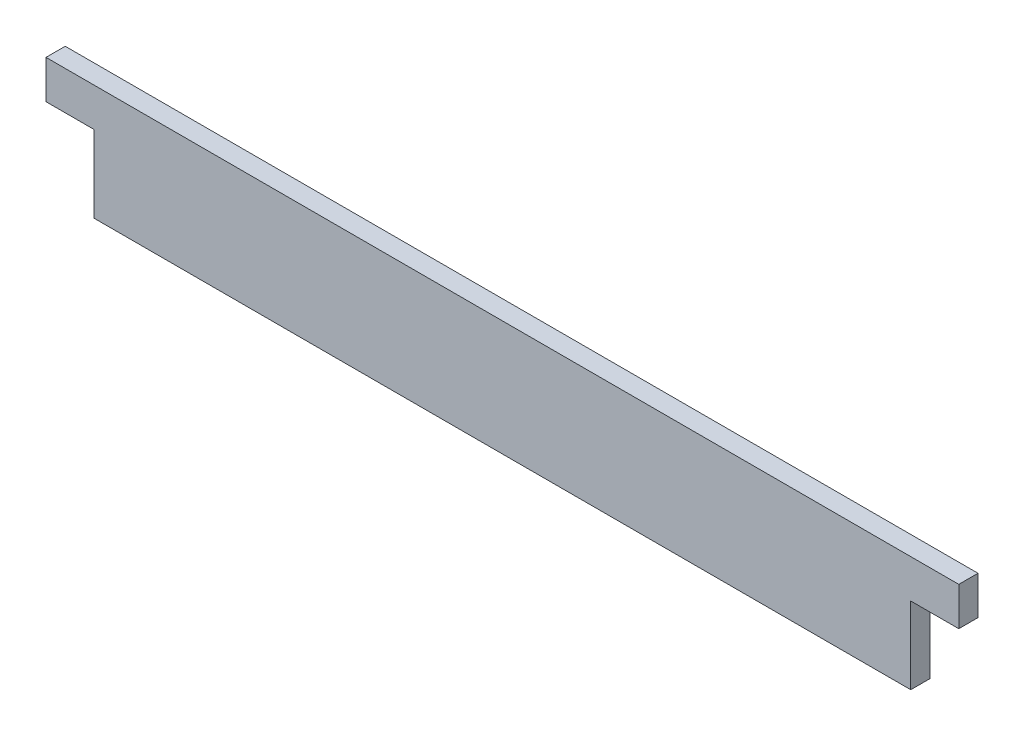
from build123d import *

# Parameters (mm, degrees)
EXTRUSION1_DEPTH = 20


with BuildPart() as part:
    # Esquisse1 → Extrusion1 (new body)
    with BuildSketch(Plane.XY):
        Polygon((-425, 0), (425, 0), (425, 80), (475, 80), (475, 120), (-475, 120), (-475, 80), (-425, 80), align=None)
    extrude(amount=EXTRUSION1_DEPTH)


solid = part.part
